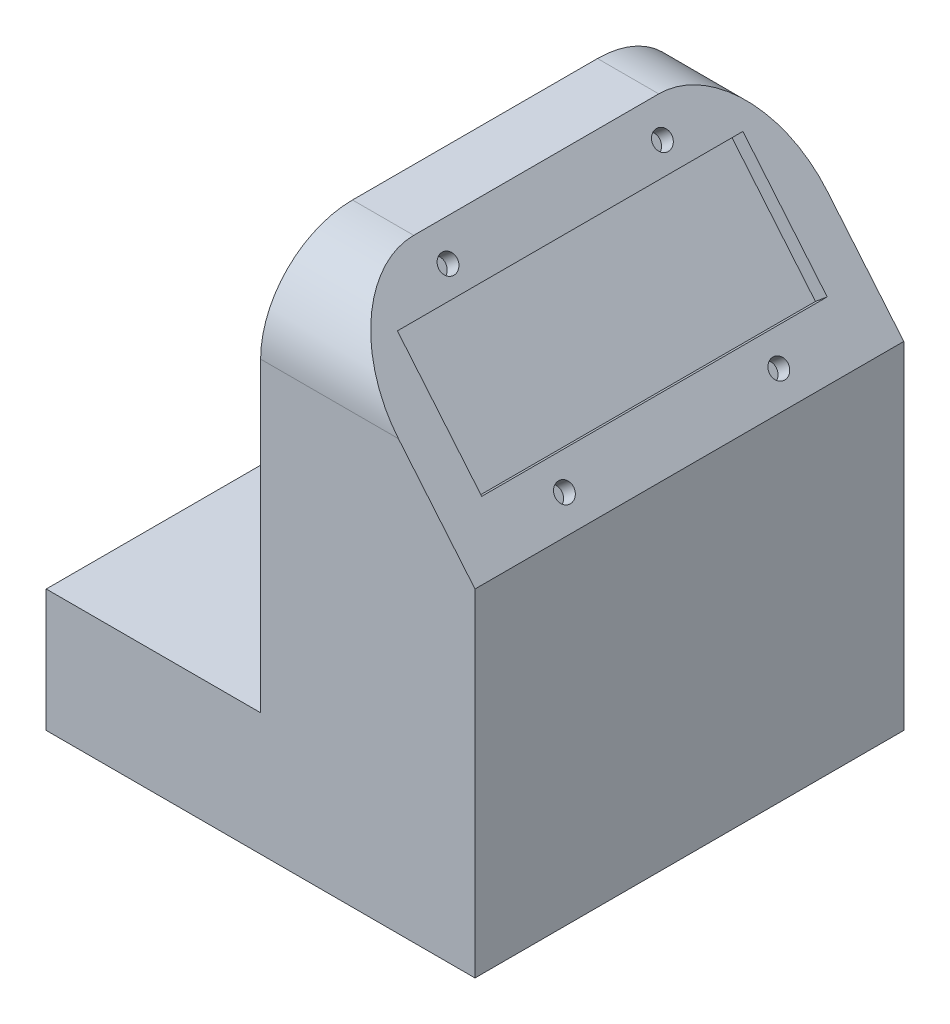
ISO-10303-21;
HEADER;
FILE_DESCRIPTION(('STEP AP214'),'2;1');
FILE_NAME('part.step','',(''),(''),'','','');
FILE_SCHEMA(('AUTOMOTIVE_DESIGN { 1 0 10303 214 1 1 1 1 }'));
ENDSEC;
DATA;
#1=APPLICATION_CONTEXT('core data for automotive mechanical design processes');
#2=APPLICATION_PROTOCOL_DEFINITION('international standard','automotive_design',2000,#1);
#3=PRODUCT_CONTEXT('',#1,'mechanical');
#4=PRODUCT('Part','Part','',(#3));
#5=PRODUCT_RELATED_PRODUCT_CATEGORY('part','',(#4));
#6=PRODUCT_DEFINITION_FORMATION('','',#4);
#7=PRODUCT_DEFINITION_CONTEXT('part definition',#1,'design');
#8=PRODUCT_DEFINITION('design','',#6,#7);
#9=PRODUCT_DEFINITION_SHAPE('','',#8);
#10=(LENGTH_UNIT() NAMED_UNIT(*) SI_UNIT(.MILLI.,.METRE.));
#11=(NAMED_UNIT(*) PLANE_ANGLE_UNIT() SI_UNIT($,.RADIAN.));
#12=(NAMED_UNIT(*) SI_UNIT($,.STERADIAN.) SOLID_ANGLE_UNIT());
#13=UNCERTAINTY_MEASURE_WITH_UNIT(LENGTH_MEASURE(1.E-05),#10,'distance_accuracy_value','');
#14=(GEOMETRIC_REPRESENTATION_CONTEXT(3) GLOBAL_UNCERTAINTY_ASSIGNED_CONTEXT((#13)) GLOBAL_UNIT_ASSIGNED_CONTEXT((#10,
#11,#12)) REPRESENTATION_CONTEXT('',''));
#15=CARTESIAN_POINT('',(0.,0.,0.));
#16=DIRECTION('',(0.,0.,1.));
#17=DIRECTION('',(1.,0.,0.));
#18=AXIS2_PLACEMENT_3D('',#15,#16,#17);
#19=CARTESIAN_POINT('',(57.15,107.95,-182.656626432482));
#20=DIRECTION('',(0.,1.,0.));
#21=DIRECTION('',(-1.,0.,0.));
#22=AXIS2_PLACEMENT_3D('',#19,#20,#21);
#23=PLANE('',#22);
#24=DIRECTION('',(1.,0.,0.));
#25=VECTOR('',#24,1.);
#26=CARTESIAN_POINT('',(-175.827081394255,107.95,-19.0500000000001));
#27=LINE('',#26,#25);
#28=CARTESIAN_POINT('',(44.45,107.95,-19.0500000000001));
#29=VERTEX_POINT('',#28);
#30=CARTESIAN_POINT('',(57.15,107.95,-19.0500000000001));
#31=VERTEX_POINT('',#30);
#32=EDGE_CURVE('E290',#29,#31,#27,.T.);
#33=ORIENTED_EDGE('',*,*,#32,.T.);
#34=DIRECTION('',(0.,0.,1.));
#35=VECTOR('',#34,1.);
#36=CARTESIAN_POINT('',(57.15,107.95,-182.656626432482));
#37=LINE('',#36,#35);
#38=CARTESIAN_POINT('',(57.15,107.95,-69.85));
#39=VERTEX_POINT('',#38);
#40=EDGE_CURVE('E209',#39,#31,#37,.T.);
#41=ORIENTED_EDGE('',*,*,#40,.F.);
#42=DIRECTION('',(1.,0.,0.));
#43=VECTOR('',#42,1.);
#44=CARTESIAN_POINT('',(-175.827081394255,107.95,-69.8499999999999));
#45=LINE('',#44,#43);
#46=CARTESIAN_POINT('',(44.45,107.95,-69.8499999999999));
#47=VERTEX_POINT('',#46);
#48=EDGE_CURVE('E57',#47,#39,#45,.T.);
#49=ORIENTED_EDGE('',*,*,#48,.F.);
#50=DIRECTION('',(0.,0.,1.));
#51=VECTOR('',#50,1.);
#52=CARTESIAN_POINT('',(44.45,107.95,-182.656626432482));
#53=LINE('',#52,#51);
#54=EDGE_CURVE('E144',#47,#29,#53,.T.);
#55=ORIENTED_EDGE('',*,*,#54,.T.);
#56=EDGE_LOOP('',(#33,#41,#49,#55));
#57=FACE_BOUND('',#56,.T.);
#58=ADVANCED_FACE('F33',(#57),#23,.T.);
#59=CARTESIAN_POINT('',(0.,25.4,-88.9));
#60=DIRECTION('',(0.,-1.,0.));
#61=DIRECTION('',(0.,0.,-1.));
#62=AXIS2_PLACEMENT_3D('',#59,#60,#61);
#63=PLANE('',#62);
#64=DIRECTION('',(0.,0.,1.));
#65=VECTOR('',#64,1.);
#66=CARTESIAN_POINT('',(44.45,25.4,-182.656626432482));
#67=LINE('',#66,#65);
#68=CARTESIAN_POINT('',(44.45,25.4,-88.9));
#69=VERTEX_POINT('',#68);
#70=CARTESIAN_POINT('',(44.45,25.4,0.));
#71=VERTEX_POINT('',#70);
#72=EDGE_CURVE('E156',#69,#71,#67,.T.);
#73=ORIENTED_EDGE('',*,*,#72,.F.);
#74=DIRECTION('',(-1.,0.,0.));
#75=VECTOR('',#74,1.);
#76=CARTESIAN_POINT('',(0.,25.4,-88.9));
#77=LINE('',#76,#75);
#78=CARTESIAN_POINT('',(0.,25.4,-88.9));
#79=VERTEX_POINT('',#78);
#80=EDGE_CURVE('E149',#69,#79,#77,.T.);
#81=ORIENTED_EDGE('',*,*,#80,.T.);
#82=DIRECTION('',(0.,0.,1.));
#83=VECTOR('',#82,1.);
#84=CARTESIAN_POINT('',(0.,25.4,0.));
#85=LINE('',#84,#83);
#86=CARTESIAN_POINT('',(0.,25.4,0.));
#87=VERTEX_POINT('',#86);
#88=EDGE_CURVE('E178',#79,#87,#85,.T.);
#89=ORIENTED_EDGE('',*,*,#88,.T.);
#90=DIRECTION('',(1.,0.,0.));
#91=VECTOR('',#90,1.);
#92=CARTESIAN_POINT('',(0.,25.4,0.));
#93=LINE('',#92,#91);
#94=EDGE_CURVE('E174',#87,#71,#93,.T.);
#95=ORIENTED_EDGE('',*,*,#94,.T.);
#96=EDGE_LOOP('',(#73,#81,#89,#95));
#97=FACE_BOUND('',#96,.T.);
#98=ADVANCED_FACE('F207',(#97),#63,.F.);
#99=CARTESIAN_POINT('',(0.,25.4,0.));
#100=DIRECTION('',(1.,0.,0.));
#101=DIRECTION('',(0.,0.,-1.));
#102=AXIS2_PLACEMENT_3D('',#99,#100,#101);
#103=PLANE('',#102);
#104=DIRECTION('',(0.,0.,1.));
#105=VECTOR('',#104,1.);
#106=CARTESIAN_POINT('',(0.,0.,0.));
#107=LINE('',#106,#105);
#108=CARTESIAN_POINT('',(0.,0.,-88.9));
#109=VERTEX_POINT('',#108);
#110=CARTESIAN_POINT('',(0.,0.,0.));
#111=VERTEX_POINT('',#110);
#112=EDGE_CURVE('E150',#109,#111,#107,.T.);
#113=ORIENTED_EDGE('',*,*,#112,.T.);
#114=DIRECTION('',(0.,-1.,0.));
#115=VECTOR('',#114,1.);
#116=CARTESIAN_POINT('',(0.,25.4,0.));
#117=LINE('',#116,#115);
#118=EDGE_CURVE('E163',#87,#111,#117,.T.);
#119=ORIENTED_EDGE('',*,*,#118,.F.);
#120=ORIENTED_EDGE('',*,*,#88,.F.);
#121=DIRECTION('',(0.,-1.,0.));
#122=VECTOR('',#121,1.);
#123=CARTESIAN_POINT('',(0.,25.4,-88.9));
#124=LINE('',#123,#122);
#125=EDGE_CURVE('E191',#79,#109,#124,.T.);
#126=ORIENTED_EDGE('',*,*,#125,.T.);
#127=EDGE_LOOP('',(#113,#119,#120,#126));
#128=FACE_BOUND('',#127,.T.);
#129=ADVANCED_FACE('F35',(#128),#103,.F.);
#130=CARTESIAN_POINT('',(0.,25.4,0.));
#131=DIRECTION('',(0.,0.,-1.));
#132=DIRECTION('',(-1.,0.,0.));
#133=AXIS2_PLACEMENT_3D('',#130,#131,#132);
#134=PLANE('',#133);
#135=DIRECTION('',(1.,0.,0.));
#136=VECTOR('',#135,1.);
#137=CARTESIAN_POINT('',(0.,0.,0.));
#138=LINE('',#137,#136);
#139=CARTESIAN_POINT('',(88.9,0.,0.));
#140=VERTEX_POINT('',#139);
#141=EDGE_CURVE('E154',#111,#140,#138,.T.);
#142=ORIENTED_EDGE('',*,*,#141,.T.);
#143=DIRECTION('',(0.,-1.,0.));
#144=VECTOR('',#143,1.);
#145=CARTESIAN_POINT('',(88.9,25.4,0.));
#146=LINE('',#145,#144);
#147=CARTESIAN_POINT('',(88.9,69.85,0.));
#148=VERTEX_POINT('',#147);
#149=EDGE_CURVE('E165',#148,#140,#146,.T.);
#150=ORIENTED_EDGE('',*,*,#149,.F.);
#151=DIRECTION('',(-0.64018439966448,0.768221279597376,0.));
#152=VECTOR('',#151,1.);
#153=CARTESIAN_POINT('',(88.9,69.85,0.));
#154=LINE('',#153,#152);
#155=CARTESIAN_POINT('',(73.025,88.9,0.));
#156=VERTEX_POINT('',#155);
#157=EDGE_CURVE('E214',#148,#156,#154,.T.);
#158=ORIENTED_EDGE('',*,*,#157,.T.);
#159=DIRECTION('',(1.,0.,0.));
#160=VECTOR('',#159,1.);
#161=CARTESIAN_POINT('',(-175.827081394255,88.8999999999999,0.));
#162=LINE('',#161,#160);
#163=CARTESIAN_POINT('',(44.45,88.8999999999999,0.));
#164=VERTEX_POINT('',#163);
#165=EDGE_CURVE('E49',#164,#156,#162,.T.);
#166=ORIENTED_EDGE('',*,*,#165,.F.);
#167=DIRECTION('',(0.,-1.,0.));
#168=VECTOR('',#167,1.);
#169=CARTESIAN_POINT('',(44.45,107.95,0.));
#170=LINE('',#169,#168);
#171=EDGE_CURVE('E37',#164,#71,#170,.T.);
#172=ORIENTED_EDGE('',*,*,#171,.T.);
#173=ORIENTED_EDGE('',*,*,#94,.F.);
#174=ORIENTED_EDGE('',*,*,#118,.T.);
#175=EDGE_LOOP('',(#142,#150,#158,#166,#172,#173,#174));
#176=FACE_BOUND('',#175,.T.);
#177=ADVANCED_FACE('F325',(#176),#134,.F.);
#178=CARTESIAN_POINT('',(88.9,25.4,0.));
#179=DIRECTION('',(-1.,0.,0.));
#180=DIRECTION('',(0.,0.,1.));
#181=AXIS2_PLACEMENT_3D('',#178,#179,#180);
#182=PLANE('',#181);
#183=DIRECTION('',(0.,0.,-1.));
#184=VECTOR('',#183,1.);
#185=CARTESIAN_POINT('',(88.9,0.,0.));
#186=LINE('',#185,#184);
#187=CARTESIAN_POINT('',(88.9,0.,-88.9));
#188=VERTEX_POINT('',#187);
#189=EDGE_CURVE('E186',#140,#188,#186,.T.);
#190=ORIENTED_EDGE('',*,*,#189,.T.);
#191=DIRECTION('',(0.,-1.,0.));
#192=VECTOR('',#191,1.);
#193=CARTESIAN_POINT('',(88.9,25.4,-88.9));
#194=LINE('',#193,#192);
#195=CARTESIAN_POINT('',(88.9,69.85,-88.9));
#196=VERTEX_POINT('',#195);
#197=EDGE_CURVE('E170',#196,#188,#194,.T.);
#198=ORIENTED_EDGE('',*,*,#197,.F.);
#199=DIRECTION('',(0.,0.,1.));
#200=VECTOR('',#199,1.);
#201=CARTESIAN_POINT('',(88.9,69.85,-182.656626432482));
#202=LINE('',#201,#200);
#203=EDGE_CURVE('E217',#196,#148,#202,.T.);
#204=ORIENTED_EDGE('',*,*,#203,.T.);
#205=ORIENTED_EDGE('',*,*,#149,.T.);
#206=EDGE_LOOP('',(#190,#198,#204,#205));
#207=FACE_BOUND('',#206,.T.);
#208=ADVANCED_FACE('F199',(#207),#182,.F.);
#209=CARTESIAN_POINT('',(0.,25.4,-88.9));
#210=DIRECTION('',(0.,0.,1.));
#211=DIRECTION('',(1.,0.,0.));
#212=AXIS2_PLACEMENT_3D('',#209,#210,#211);
#213=PLANE('',#212);
#214=ORIENTED_EDGE('',*,*,#80,.F.);
#215=DIRECTION('',(0.,1.,0.));
#216=VECTOR('',#215,1.);
#217=CARTESIAN_POINT('',(44.45,107.95,-88.9));
#218=LINE('',#217,#216);
#219=CARTESIAN_POINT('',(44.45,88.8999999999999,-88.9));
#220=VERTEX_POINT('',#219);
#221=EDGE_CURVE('E142',#69,#220,#218,.T.);
#222=ORIENTED_EDGE('',*,*,#221,.T.);
#223=DIRECTION('',(1.,0.,0.));
#224=VECTOR('',#223,1.);
#225=CARTESIAN_POINT('',(-175.827081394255,88.8999999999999,-88.9));
#226=LINE('',#225,#224);
#227=CARTESIAN_POINT('',(73.0250000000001,88.8999999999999,-88.9));
#228=VERTEX_POINT('',#227);
#229=EDGE_CURVE('E127',#220,#228,#226,.T.);
#230=ORIENTED_EDGE('',*,*,#229,.T.);
#231=DIRECTION('',(0.64018439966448,-0.768221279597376,0.));
#232=VECTOR('',#231,1.);
#233=CARTESIAN_POINT('',(88.9,69.85,-88.9));
#234=LINE('',#233,#232);
#235=EDGE_CURVE('E151',#228,#196,#234,.T.);
#236=ORIENTED_EDGE('',*,*,#235,.T.);
#237=ORIENTED_EDGE('',*,*,#197,.T.);
#238=DIRECTION('',(-1.,0.,0.));
#239=VECTOR('',#238,1.);
#240=CARTESIAN_POINT('',(0.,0.,-88.9));
#241=LINE('',#240,#239);
#242=EDGE_CURVE('E189',#188,#109,#241,.T.);
#243=ORIENTED_EDGE('',*,*,#242,.T.);
#244=ORIENTED_EDGE('',*,*,#125,.F.);
#245=EDGE_LOOP('',(#214,#222,#230,#236,#237,#243,#244));
#246=FACE_BOUND('',#245,.T.);
#247=ADVANCED_FACE('F147',(#246),#213,.F.);
#248=CARTESIAN_POINT('',(0.,0.,-88.9));
#249=DIRECTION('',(0.,-1.,0.));
#250=DIRECTION('',(0.,0.,-1.));
#251=AXIS2_PLACEMENT_3D('',#248,#249,#250);
#252=PLANE('',#251);
#253=ORIENTED_EDGE('',*,*,#112,.F.);
#254=ORIENTED_EDGE('',*,*,#242,.F.);
#255=ORIENTED_EDGE('',*,*,#189,.F.);
#256=ORIENTED_EDGE('',*,*,#141,.F.);
#257=EDGE_LOOP('',(#253,#254,#255,#256));
#258=FACE_BOUND('',#257,.T.);
#259=ADVANCED_FACE('F202',(#258),#252,.T.);
#260=CARTESIAN_POINT('',(44.45,107.95,-182.656626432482));
#261=DIRECTION('',(-1.,0.,0.));
#262=DIRECTION('',(0.,-1.,0.));
#263=AXIS2_PLACEMENT_3D('',#260,#261,#262);
#264=PLANE('',#263);
#265=CARTESIAN_POINT('',(44.45,88.9,-19.05));
#266=DIRECTION('',(-1.,0.,0.));
#267=DIRECTION('',(0.,-1.,0.));
#268=AXIS2_PLACEMENT_3D('',#265,#266,#267);
#269=CIRCLE('',#268,19.05);
#270=EDGE_CURVE('E289',#164,#29,#269,.T.);
#271=ORIENTED_EDGE('',*,*,#270,.T.);
#272=ORIENTED_EDGE('',*,*,#54,.F.);
#273=CARTESIAN_POINT('',(44.45,88.9,-69.85));
#274=DIRECTION('',(-1.,0.,0.));
#275=DIRECTION('',(0.,-1.,0.));
#276=AXIS2_PLACEMENT_3D('',#273,#274,#275);
#277=CIRCLE('',#276,19.05);
#278=EDGE_CURVE('E130',#47,#220,#277,.T.);
#279=ORIENTED_EDGE('',*,*,#278,.T.);
#280=ORIENTED_EDGE('',*,*,#221,.F.);
#281=ORIENTED_EDGE('',*,*,#72,.T.);
#282=ORIENTED_EDGE('',*,*,#171,.F.);
#283=EDGE_LOOP('',(#271,#272,#279,#280,#281,#282));
#284=FACE_BOUND('',#283,.T.);
#285=ADVANCED_FACE('F140',(#284),#264,.T.);
#286=CARTESIAN_POINT('',(88.9,69.85,-182.656626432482));
#287=DIRECTION('',(0.768221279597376,0.64018439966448,0.));
#288=DIRECTION('',(-0.64018439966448,0.768221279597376,0.));
#289=AXIS2_PLACEMENT_3D('',#286,#287,#288);
#290=PLANE('',#289);
#291=CARTESIAN_POINT('',(73.025,88.9,-19.05));
#292=DIRECTION('',(0.768221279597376,0.64018439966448,0.));
#293=DIRECTION('',(0.64018439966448,-0.768221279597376,0.));
#294=AXIS2_PLACEMENT_3D('',#291,#292,#293);
#295=ELLIPSE('',#294,24.7975427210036,19.05);
#296=EDGE_CURVE('E11',#156,#31,#295,.F.);
#297=ORIENTED_EDGE('',*,*,#296,.F.);
#298=ORIENTED_EDGE('',*,*,#157,.F.);
#299=ORIENTED_EDGE('',*,*,#203,.F.);
#300=ORIENTED_EDGE('',*,*,#235,.F.);
#301=CARTESIAN_POINT('',(73.025,88.9,-69.85));
#302=DIRECTION('',(0.768221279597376,0.64018439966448,0.));
#303=DIRECTION('',(0.64018439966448,-0.768221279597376,0.));
#304=AXIS2_PLACEMENT_3D('',#301,#302,#303);
#305=ELLIPSE('',#304,24.7975427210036,19.05);
#306=EDGE_CURVE('E43',#39,#228,#305,.F.);
#307=ORIENTED_EDGE('',*,*,#306,.F.);
#308=ORIENTED_EDGE('',*,*,#40,.T.);
#309=EDGE_LOOP('',(#297,#298,#299,#300,#307,#308));
#310=FACE_BOUND('',#309,.T.);
#311=CARTESIAN_POINT('',(85.220406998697,74.2655116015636,-66.675));
#312=DIRECTION('',(0.768221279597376,0.64018439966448,0.));
#313=DIRECTION('',(-0.64018439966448,0.768221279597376,0.));
#314=AXIS2_PLACEMENT_3D('',#311,#312,#313);
#315=CIRCLE('',#314,1.90500000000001);
#316=CARTESIAN_POINT('',(84.0008557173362,75.7289731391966,-66.675));
#317=VERTEX_POINT('',#316);
#318=EDGE_CURVE('E134',#317,#317,#315,.T.);
#319=ORIENTED_EDGE('',*,*,#318,.F.);
#320=EDGE_LOOP('',(#319));
#321=FACE_BOUND('',#320,.T.);
#322=CARTESIAN_POINT('',(61.0817749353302,103.231870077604,-66.675));
#323=DIRECTION('',(0.768221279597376,0.64018439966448,0.));
#324=DIRECTION('',(-0.64018439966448,0.768221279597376,0.));
#325=AXIS2_PLACEMENT_3D('',#322,#323,#324);
#326=CIRCLE('',#325,1.905);
#327=CARTESIAN_POINT('',(59.8622236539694,104.695331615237,-66.675));
#328=VERTEX_POINT('',#327);
#329=EDGE_CURVE('E278',#328,#328,#326,.T.);
#330=ORIENTED_EDGE('',*,*,#329,.F.);
#331=EDGE_LOOP('',(#330));
#332=FACE_BOUND('',#331,.T.);
#333=CARTESIAN_POINT('',(85.220406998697,74.2655116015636,-22.225));
#334=DIRECTION('',(0.768221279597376,0.64018439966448,0.));
#335=DIRECTION('',(-0.64018439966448,0.768221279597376,0.));
#336=AXIS2_PLACEMENT_3D('',#333,#334,#335);
#337=CIRCLE('',#336,1.905);
#338=CARTESIAN_POINT('',(84.0008557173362,75.7289731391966,-22.225));
#339=VERTEX_POINT('',#338);
#340=EDGE_CURVE('E272',#339,#339,#337,.T.);
#341=ORIENTED_EDGE('',*,*,#340,.F.);
#342=EDGE_LOOP('',(#341));
#343=FACE_BOUND('',#342,.T.);
#344=CARTESIAN_POINT('',(61.0817749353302,103.231870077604,-22.225));
#345=DIRECTION('',(0.768221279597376,0.64018439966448,0.));
#346=DIRECTION('',(-0.64018439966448,0.768221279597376,0.));
#347=AXIS2_PLACEMENT_3D('',#344,#345,#346);
#348=CIRCLE('',#347,1.905);
#349=CARTESIAN_POINT('',(59.8622236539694,104.695331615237,-22.225));
#350=VERTEX_POINT('',#349);
#351=EDGE_CURVE('E266',#350,#350,#348,.T.);
#352=ORIENTED_EDGE('',*,*,#351,.F.);
#353=EDGE_LOOP('',(#352));
#354=FACE_BOUND('',#353,.T.);
#355=DIRECTION('',(0.64018439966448,-0.768221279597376,0.));
#356=VECTOR('',#355,1.);
#357=CARTESIAN_POINT('',(64.1769210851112,99.5176946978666,-8.63600000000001));
#358=LINE('',#357,#356);
#359=CARTESIAN_POINT('',(64.1769210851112,99.5176946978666,-8.63600000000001));
#360=VERTEX_POINT('',#359);
#361=CARTESIAN_POINT('',(81.6571561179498,78.5414126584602,-8.636));
#362=VERTEX_POINT('',#361);
#363=EDGE_CURVE('E251',#360,#362,#358,.T.);
#364=ORIENTED_EDGE('',*,*,#363,.F.);
#365=DIRECTION('',(0.,0.,1.));
#366=VECTOR('',#365,1.);
#367=CARTESIAN_POINT('',(64.1769210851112,99.5176946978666,-8.63600000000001));
#368=LINE('',#367,#366);
#369=CARTESIAN_POINT('',(64.1769210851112,99.5176946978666,-80.264));
#370=VERTEX_POINT('',#369);
#371=EDGE_CURVE('E229',#370,#360,#368,.T.);
#372=ORIENTED_EDGE('',*,*,#371,.F.);
#373=DIRECTION('',(-0.64018439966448,0.768221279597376,0.));
#374=VECTOR('',#373,1.);
#375=CARTESIAN_POINT('',(64.1769210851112,99.5176946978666,-80.264));
#376=LINE('',#375,#374);
#377=CARTESIAN_POINT('',(81.6571561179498,78.5414126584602,-80.264));
#378=VERTEX_POINT('',#377);
#379=EDGE_CURVE('E255',#378,#370,#376,.T.);
#380=ORIENTED_EDGE('',*,*,#379,.F.);
#381=DIRECTION('',(0.,0.,-1.));
#382=VECTOR('',#381,1.);
#383=CARTESIAN_POINT('',(81.6571561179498,78.5414126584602,-8.63600000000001));
#384=LINE('',#383,#382);
#385=EDGE_CURVE('E253',#362,#378,#384,.T.);
#386=ORIENTED_EDGE('',*,*,#385,.F.);
#387=EDGE_LOOP('',(#364,#372,#380,#386));
#388=FACE_BOUND('',#387,.T.);
#389=ADVANCED_FACE('F297',(#310,#321,#332,#343,#354,#388),#290,.T.);
#390=CARTESIAN_POINT('',(61.7378185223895,97.4851092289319,-8.63600000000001));
#391=DIRECTION('',(0.,0.,1.));
#392=DIRECTION('',(0.,-1.,0.));
#393=AXIS2_PLACEMENT_3D('',#390,#391,#392);
#394=PLANE('',#393);
#395=ORIENTED_EDGE('',*,*,#363,.T.);
#396=DIRECTION('',(0.768221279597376,0.64018439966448,0.));
#397=VECTOR('',#396,1.);
#398=CARTESIAN_POINT('',(79.2180535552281,76.5088271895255,-8.63600000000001));
#399=LINE('',#398,#397);
#400=CARTESIAN_POINT('',(79.2180535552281,76.5088271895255,-8.63600000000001));
#401=VERTEX_POINT('',#400);
#402=EDGE_CURVE('E233',#401,#362,#399,.T.);
#403=ORIENTED_EDGE('',*,*,#402,.F.);
#404=DIRECTION('',(0.64018439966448,-0.768221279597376,0.));
#405=VECTOR('',#404,1.);
#406=CARTESIAN_POINT('',(61.7378185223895,97.4851092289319,-8.63600000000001));
#407=LINE('',#406,#405);
#408=CARTESIAN_POINT('',(61.7378185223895,97.4851092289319,-8.63600000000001));
#409=VERTEX_POINT('',#408);
#410=EDGE_CURVE('E260',#409,#401,#407,.T.);
#411=ORIENTED_EDGE('',*,*,#410,.F.);
#412=DIRECTION('',(0.768221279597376,0.64018439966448,0.));
#413=VECTOR('',#412,1.);
#414=CARTESIAN_POINT('',(61.7378185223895,97.4851092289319,-8.63600000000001));
#415=LINE('',#414,#413);
#416=EDGE_CURVE('E220',#409,#360,#415,.T.);
#417=ORIENTED_EDGE('',*,*,#416,.T.);
#418=EDGE_LOOP('',(#395,#403,#411,#417));
#419=FACE_BOUND('',#418,.T.);
#420=ADVANCED_FACE('F318',(#419),#394,.F.);
#421=CARTESIAN_POINT('',(61.7378185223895,97.4851092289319,-8.63600000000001));
#422=DIRECTION('',(-0.64018439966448,0.768221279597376,0.));
#423=DIRECTION('',(-0.768221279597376,-0.64018439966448,0.));
#424=AXIS2_PLACEMENT_3D('',#421,#422,#423);
#425=PLANE('',#424);
#426=ORIENTED_EDGE('',*,*,#371,.T.);
#427=ORIENTED_EDGE('',*,*,#416,.F.);
#428=DIRECTION('',(0.,0.,1.));
#429=VECTOR('',#428,1.);
#430=CARTESIAN_POINT('',(61.7378185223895,97.4851092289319,-8.63600000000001));
#431=LINE('',#430,#429);
#432=CARTESIAN_POINT('',(61.7378185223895,97.4851092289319,-80.264));
#433=VERTEX_POINT('',#432);
#434=EDGE_CURVE('E235',#433,#409,#431,.T.);
#435=ORIENTED_EDGE('',*,*,#434,.F.);
#436=DIRECTION('',(0.768221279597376,0.64018439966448,0.));
#437=VECTOR('',#436,1.);
#438=CARTESIAN_POINT('',(61.7378185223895,97.4851092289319,-80.264));
#439=LINE('',#438,#437);
#440=EDGE_CURVE('E221',#433,#370,#439,.T.);
#441=ORIENTED_EDGE('',*,*,#440,.T.);
#442=EDGE_LOOP('',(#426,#427,#435,#441));
#443=FACE_BOUND('',#442,.T.);
#444=ADVANCED_FACE('F349',(#443),#425,.F.);
#445=CARTESIAN_POINT('',(61.7378185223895,97.4851092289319,-80.264));
#446=DIRECTION('',(0.,0.,-1.));
#447=DIRECTION('',(0.,1.,0.));
#448=AXIS2_PLACEMENT_3D('',#445,#446,#447);
#449=PLANE('',#448);
#450=ORIENTED_EDGE('',*,*,#379,.T.);
#451=ORIENTED_EDGE('',*,*,#440,.F.);
#452=DIRECTION('',(-0.64018439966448,0.768221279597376,0.));
#453=VECTOR('',#452,1.);
#454=CARTESIAN_POINT('',(61.7378185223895,97.4851092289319,-80.264));
#455=LINE('',#454,#453);
#456=CARTESIAN_POINT('',(79.2180535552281,76.5088271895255,-80.264));
#457=VERTEX_POINT('',#456);
#458=EDGE_CURVE('E241',#457,#433,#455,.T.);
#459=ORIENTED_EDGE('',*,*,#458,.F.);
#460=DIRECTION('',(0.768221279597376,0.64018439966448,0.));
#461=VECTOR('',#460,1.);
#462=CARTESIAN_POINT('',(79.2180535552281,76.5088271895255,-80.264));
#463=LINE('',#462,#461);
#464=EDGE_CURVE('E226',#457,#378,#463,.T.);
#465=ORIENTED_EDGE('',*,*,#464,.T.);
#466=EDGE_LOOP('',(#450,#451,#459,#465));
#467=FACE_BOUND('',#466,.T.);
#468=ADVANCED_FACE('F358',(#467),#449,.F.);
#469=CARTESIAN_POINT('',(79.2180535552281,76.5088271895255,-8.63600000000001));
#470=DIRECTION('',(0.64018439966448,-0.768221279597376,0.));
#471=DIRECTION('',(0.768221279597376,0.64018439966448,0.));
#472=AXIS2_PLACEMENT_3D('',#469,#470,#471);
#473=PLANE('',#472);
#474=ORIENTED_EDGE('',*,*,#385,.T.);
#475=ORIENTED_EDGE('',*,*,#464,.F.);
#476=DIRECTION('',(0.,0.,-1.));
#477=VECTOR('',#476,1.);
#478=CARTESIAN_POINT('',(79.2180535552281,76.5088271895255,-8.63600000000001));
#479=LINE('',#478,#477);
#480=EDGE_CURVE('E247',#401,#457,#479,.T.);
#481=ORIENTED_EDGE('',*,*,#480,.F.);
#482=ORIENTED_EDGE('',*,*,#402,.T.);
#483=EDGE_LOOP('',(#474,#475,#481,#482));
#484=FACE_BOUND('',#483,.T.);
#485=ADVANCED_FACE('F367',(#484),#473,.F.);
#486=CARTESIAN_POINT('',(79.2180535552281,76.5088271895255,-8.63600000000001));
#487=DIRECTION('',(0.768221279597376,0.64018439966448,0.));
#488=DIRECTION('',(-0.64018439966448,0.768221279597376,0.));
#489=AXIS2_PLACEMENT_3D('',#486,#487,#488);
#490=PLANE('',#489);
#491=ORIENTED_EDGE('',*,*,#410,.T.);
#492=ORIENTED_EDGE('',*,*,#480,.T.);
#493=ORIENTED_EDGE('',*,*,#458,.T.);
#494=ORIENTED_EDGE('',*,*,#434,.T.);
#495=EDGE_LOOP('',(#491,#492,#493,#494));
#496=FACE_BOUND('',#495,.T.);
#497=ADVANCED_FACE('F376',(#496),#490,.T.);
#498=CARTESIAN_POINT('',(58.6426723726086,101.199284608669,-22.225));
#499=DIRECTION('',(0.768221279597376,0.64018439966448,0.));
#500=DIRECTION('',(-0.64018439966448,0.768221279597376,0.));
#501=AXIS2_PLACEMENT_3D('',#498,#499,#500);
#502=CYLINDRICAL_SURFACE('',#501,1.905);
#503=CARTESIAN_POINT('',(58.6426723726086,101.199284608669,-22.225));
#504=DIRECTION('',(0.768221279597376,0.64018439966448,0.));
#505=DIRECTION('',(-0.64018439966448,0.768221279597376,0.));
#506=AXIS2_PLACEMENT_3D('',#503,#504,#505);
#507=CIRCLE('',#506,1.905);
#508=CARTESIAN_POINT('',(57.4231210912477,102.662746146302,-22.225));
#509=VERTEX_POINT('',#508);
#510=EDGE_CURVE('E254',#509,#509,#507,.T.);
#511=CARTESIAN_POINT('',(57.4231210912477,102.662746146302,-22.225));
#512=CARTESIAN_POINT('',(57.4485284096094,102.683918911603,-22.225));
#513=CARTESIAN_POINT('',(57.4739357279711,102.705091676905,-22.225));
#514=CARTESIAN_POINT('',(57.5247503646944,102.747437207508,-22.225));
#515=CARTESIAN_POINT('',(57.5501576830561,102.768609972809,-22.225));
#516=CARTESIAN_POINT('',(57.6009723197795,102.810955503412,-22.225));
#517=CARTESIAN_POINT('',(57.6263796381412,102.832128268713,-22.225));
#518=CARTESIAN_POINT('',(57.6771942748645,102.874473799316,-22.225));
#519=CARTESIAN_POINT('',(57.7026015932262,102.895646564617,-22.225));
#520=CARTESIAN_POINT('',(57.7534162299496,102.93799209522,-22.225));
#521=CARTESIAN_POINT('',(57.7788235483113,102.959164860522,-22.225));
#522=CARTESIAN_POINT('',(57.8296381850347,103.001510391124,-22.225));
#523=CARTESIAN_POINT('',(57.8550455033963,103.022683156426,-22.225));
#524=CARTESIAN_POINT('',(57.9058601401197,103.065028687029,-22.225));
#525=CARTESIAN_POINT('',(57.9312674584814,103.08620145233,-22.225));
#526=CARTESIAN_POINT('',(57.9820820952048,103.128546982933,-22.225));
#527=CARTESIAN_POINT('',(58.0074894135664,103.149719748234,-22.225));
#528=CARTESIAN_POINT('',(58.0583040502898,103.192065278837,-22.225));
#529=CARTESIAN_POINT('',(58.0837113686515,103.213238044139,-22.225));
#530=CARTESIAN_POINT('',(58.1345260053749,103.255583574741,-22.225));
#531=CARTESIAN_POINT('',(58.1599333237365,103.276756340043,-22.225));
#532=CARTESIAN_POINT('',(58.2107479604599,103.319101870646,-22.225));
#533=CARTESIAN_POINT('',(58.2361552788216,103.340274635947,-22.225));
#534=CARTESIAN_POINT('',(58.286969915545,103.38262016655,-22.225));
#535=CARTESIAN_POINT('',(58.3123772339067,103.403792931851,-22.225));
#536=CARTESIAN_POINT('',(58.36319187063,103.446138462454,-22.225));
#537=CARTESIAN_POINT('',(58.3885991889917,103.467311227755,-22.225));
#538=CARTESIAN_POINT('',(58.4394138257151,103.509656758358,-22.225));
#539=CARTESIAN_POINT('',(58.4648211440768,103.53082952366,-22.225));
#540=CARTESIAN_POINT('',(58.5156357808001,103.573175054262,-22.225));
#541=CARTESIAN_POINT('',(58.5410430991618,103.594347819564,-22.225));
#542=CARTESIAN_POINT('',(58.5918577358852,103.636693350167,-22.225));
#543=CARTESIAN_POINT('',(58.6172650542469,103.657866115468,-22.225));
#544=CARTESIAN_POINT('',(58.6680796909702,103.700211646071,-22.225));
#545=CARTESIAN_POINT('',(58.6934870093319,103.721384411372,-22.225));
#546=CARTESIAN_POINT('',(58.7443016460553,103.763729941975,-22.225));
#547=CARTESIAN_POINT('',(58.769708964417,103.784902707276,-22.225));
#548=CARTESIAN_POINT('',(58.8205236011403,103.827248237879,-22.225));
#549=CARTESIAN_POINT('',(58.845930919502,103.848421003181,-22.225));
#550=CARTESIAN_POINT('',(58.8967455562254,103.890766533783,-22.225));
#551=CARTESIAN_POINT('',(58.9221528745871,103.911939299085,-22.225));
#552=CARTESIAN_POINT('',(58.9729675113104,103.954284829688,-22.225));
#553=CARTESIAN_POINT('',(58.9983748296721,103.975457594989,-22.225));
#554=CARTESIAN_POINT('',(59.0491894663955,104.017803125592,-22.225));
#555=CARTESIAN_POINT('',(59.0745967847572,104.038975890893,-22.225));
#556=CARTESIAN_POINT('',(59.1254114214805,104.081321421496,-22.225));
#557=CARTESIAN_POINT('',(59.1508187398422,104.102494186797,-22.225));
#558=CARTESIAN_POINT('',(59.2016333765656,104.1448397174,-22.225));
#559=CARTESIAN_POINT('',(59.2270406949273,104.166012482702,-22.225));
#560=CARTESIAN_POINT('',(59.2778553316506,104.208358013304,-22.225));
#561=CARTESIAN_POINT('',(59.3032626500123,104.229530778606,-22.225));
#562=CARTESIAN_POINT('',(59.3540772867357,104.271876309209,-22.225));
#563=CARTESIAN_POINT('',(59.3794846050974,104.29304907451,-22.225));
#564=CARTESIAN_POINT('',(59.4302992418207,104.335394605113,-22.225));
#565=CARTESIAN_POINT('',(59.4557065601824,104.356567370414,-22.225));
#566=CARTESIAN_POINT('',(59.5065211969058,104.398912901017,-22.225));
#567=CARTESIAN_POINT('',(59.5319285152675,104.420085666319,-22.225));
#568=CARTESIAN_POINT('',(59.5827431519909,104.462431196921,-22.225));
#569=CARTESIAN_POINT('',(59.6081504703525,104.483603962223,-22.225));
#570=CARTESIAN_POINT('',(59.6589651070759,104.525949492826,-22.225));
#571=CARTESIAN_POINT('',(59.6843724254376,104.547122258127,-22.225));
#572=CARTESIAN_POINT('',(59.735187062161,104.58946778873,-22.225));
#573=CARTESIAN_POINT('',(59.7605943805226,104.610640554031,-22.225));
#574=CARTESIAN_POINT('',(59.811409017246,104.652986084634,-22.225));
#575=CARTESIAN_POINT('',(59.8368163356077,104.674158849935,-22.225));
#576=CARTESIAN_POINT('',(59.8622236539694,104.695331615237,-22.225));
#577=B_SPLINE_CURVE_WITH_KNOTS('',3,(#511,#512,#513,#514,#515,#516,#517,#518,#519,#520,#521,
#522,#523,#524,#525,#526,#527,#528,#529,#530,#531,#532,#533,#534,#535,#536,#537,#538,#539,#540,
#541,#542,#543,#544,#545,#546,#547,#548,#549,#550,#551,#552,#553,#554,#555,#556,#557,#558,#559,
#560,#561,#562,#563,#564,#565,#566,#567,#568,#569,#570,#571,#572,#573,#574,#575,#576),
.UNSPECIFIED.,.F.,.F.,(4,2,2,2,2,2,2,2,2,2,2,2,2,2,2,2,2,2,2,2,2,2,2,2,2,2,2,2,2,2,2,2,4),(0.,
0.0992187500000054,0.198437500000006,0.297656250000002,0.396875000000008,0.496093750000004,
0.595312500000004,0.694531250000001,0.793750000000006,0.892968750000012,0.992187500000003,
1.09140625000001,1.190625,1.28984375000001,1.3890625,1.48828125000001,1.58750000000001,
1.68671875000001,1.78593750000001,1.88515625,1.98437500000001,2.08359375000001,2.18281250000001,
2.28203125,2.38125000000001,2.48046875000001,2.57968750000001,2.67890625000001,2.77812500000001,
2.87734375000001,2.9765625,3.07578125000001,3.17500000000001),.UNSPECIFIED.);
#578=EDGE_CURVE('BSEAM385',#509,#350,#577,.T.);
#579=ORIENTED_EDGE('',*,*,#510,.F.);
#580=ORIENTED_EDGE('',*,*,#351,.T.);
#581=ORIENTED_EDGE('',*,*,#578,.T.);
#582=ORIENTED_EDGE('',*,*,#578,.F.);
#583=EDGE_LOOP('',(#579,#581,#580,#582));
#584=FACE_BOUND('',#583,.T.);
#585=ADVANCED_FACE('F385',(#584),#502,.F.);
#586=CARTESIAN_POINT('',(58.6426723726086,101.199284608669,-22.225));
#587=DIRECTION('',(0.768221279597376,0.64018439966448,0.));
#588=DIRECTION('',(-0.64018439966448,0.768221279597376,0.));
#589=AXIS2_PLACEMENT_3D('',#586,#587,#588);
#590=PLANE('',#589);
#591=ORIENTED_EDGE('',*,*,#510,.T.);
#592=EDGE_LOOP('',(#591));
#593=FACE_BOUND('',#592,.T.);
#594=ADVANCED_FACE('F394',(#593),#590,.T.);
#595=CARTESIAN_POINT('',(82.7813044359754,72.2329261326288,-22.225));
#596=DIRECTION('',(0.768221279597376,0.64018439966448,0.));
#597=DIRECTION('',(-0.64018439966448,0.768221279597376,0.));
#598=AXIS2_PLACEMENT_3D('',#595,#596,#597);
#599=CYLINDRICAL_SURFACE('',#598,1.905);
#600=CARTESIAN_POINT('',(82.7813044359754,72.2329261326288,-22.225));
#601=DIRECTION('',(0.768221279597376,0.64018439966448,0.));
#602=DIRECTION('',(-0.64018439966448,0.768221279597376,0.));
#603=AXIS2_PLACEMENT_3D('',#600,#601,#602);
#604=CIRCLE('',#603,1.905);
#605=CARTESIAN_POINT('',(81.5617531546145,73.6963876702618,-22.225));
#606=VERTEX_POINT('',#605);
#607=EDGE_CURVE('E269',#606,#606,#604,.T.);
#608=CARTESIAN_POINT('',(81.5617531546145,73.6963876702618,-22.225));
#609=CARTESIAN_POINT('',(81.5871604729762,73.7175604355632,-22.225));
#610=CARTESIAN_POINT('',(81.6125677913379,73.7387332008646,-22.225));
#611=CARTESIAN_POINT('',(81.6633824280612,73.7810787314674,-22.225));
#612=CARTESIAN_POINT('',(81.6887897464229,73.8022514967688,-22.225));
#613=CARTESIAN_POINT('',(81.7396043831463,73.8445970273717,-22.225));
#614=CARTESIAN_POINT('',(81.765011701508,73.865769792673,-22.225));
#615=CARTESIAN_POINT('',(81.8158263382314,73.9081153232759,-22.225));
#616=CARTESIAN_POINT('',(81.841233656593,73.9292880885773,-22.225));
#617=CARTESIAN_POINT('',(81.8920482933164,73.9716336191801,-22.225));
#618=CARTESIAN_POINT('',(81.9174556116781,73.9928063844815,-22.225));
#619=CARTESIAN_POINT('',(81.9682702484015,74.0351519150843,-22.225));
#620=CARTESIAN_POINT('',(81.9936775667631,74.0563246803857,-22.225));
#621=CARTESIAN_POINT('',(82.0444922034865,74.0986702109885,-22.225));
#622=CARTESIAN_POINT('',(82.0698995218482,74.1198429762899,-22.225));
#623=CARTESIAN_POINT('',(82.1207141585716,74.1621885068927,-22.225));
#624=CARTESIAN_POINT('',(82.1461214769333,74.1833612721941,-22.225));
#625=CARTESIAN_POINT('',(82.1969361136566,74.2257068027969,-22.225));
#626=CARTESIAN_POINT('',(82.2223434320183,74.2468795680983,-22.225));
#627=CARTESIAN_POINT('',(82.2731580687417,74.2892250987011,-22.225));
#628=CARTESIAN_POINT('',(82.2985653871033,74.3103978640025,-22.225));
#629=CARTESIAN_POINT('',(82.3493800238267,74.3527433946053,-22.225));
#630=CARTESIAN_POINT('',(82.3747873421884,74.3739161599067,-22.225));
#631=CARTESIAN_POINT('',(82.4256019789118,74.4162616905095,-22.225));
#632=CARTESIAN_POINT('',(82.4510092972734,74.4374344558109,-22.225));
#633=CARTESIAN_POINT('',(82.5018239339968,74.4797799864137,-22.225));
#634=CARTESIAN_POINT('',(82.5272312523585,74.5009527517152,-22.225));
#635=CARTESIAN_POINT('',(82.5780458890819,74.543298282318,-22.225));
#636=CARTESIAN_POINT('',(82.6034532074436,74.5644710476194,-22.225));
#637=CARTESIAN_POINT('',(82.6542678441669,74.6068165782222,-22.225));
#638=CARTESIAN_POINT('',(82.6796751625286,74.6279893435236,-22.225));
#639=CARTESIAN_POINT('',(82.730489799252,74.6703348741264,-22.225));
#640=CARTESIAN_POINT('',(82.7558971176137,74.6915076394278,-22.225));
#641=CARTESIAN_POINT('',(82.806711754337,74.7338531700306,-22.225));
#642=CARTESIAN_POINT('',(82.8321190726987,74.755025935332,-22.225));
#643=CARTESIAN_POINT('',(82.8829337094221,74.7973714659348,-22.225));
#644=CARTESIAN_POINT('',(82.9083410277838,74.8185442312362,-22.225));
#645=CARTESIAN_POINT('',(82.9591556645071,74.860889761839,-22.225));
#646=CARTESIAN_POINT('',(82.9845629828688,74.8820625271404,-22.225));
#647=CARTESIAN_POINT('',(83.0353776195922,74.9244080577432,-22.225));
#648=CARTESIAN_POINT('',(83.0607849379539,74.9455808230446,-22.225));
#649=CARTESIAN_POINT('',(83.1115995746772,74.9879263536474,-22.225));
#650=CARTESIAN_POINT('',(83.1370068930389,75.0090991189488,-22.225));
#651=CARTESIAN_POINT('',(83.1878215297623,75.0514446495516,-22.225));
#652=CARTESIAN_POINT('',(83.213228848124,75.0726174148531,-22.225));
#653=CARTESIAN_POINT('',(83.2640434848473,75.1149629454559,-22.225));
#654=CARTESIAN_POINT('',(83.289450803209,75.1361357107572,-22.225));
#655=CARTESIAN_POINT('',(83.3402654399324,75.1784812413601,-22.225));
#656=CARTESIAN_POINT('',(83.3656727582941,75.1996540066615,-22.225));
#657=CARTESIAN_POINT('',(83.4164873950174,75.2419995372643,-22.225));
#658=CARTESIAN_POINT('',(83.4418947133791,75.2631723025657,-22.225));
#659=CARTESIAN_POINT('',(83.4927093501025,75.3055178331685,-22.225));
#660=CARTESIAN_POINT('',(83.5181166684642,75.3266905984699,-22.225));
#661=CARTESIAN_POINT('',(83.5689313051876,75.3690361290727,-22.225));
#662=CARTESIAN_POINT('',(83.5943386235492,75.3902088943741,-22.225));
#663=CARTESIAN_POINT('',(83.6451532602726,75.4325544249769,-22.225));
#664=CARTESIAN_POINT('',(83.6705605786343,75.4537271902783,-22.225));
#665=CARTESIAN_POINT('',(83.7213752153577,75.4960727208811,-22.225));
#666=CARTESIAN_POINT('',(83.7467825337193,75.5172454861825,-22.225));
#667=CARTESIAN_POINT('',(83.7975971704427,75.5595910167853,-22.225));
#668=CARTESIAN_POINT('',(83.8230044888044,75.5807637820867,-22.225));
#669=CARTESIAN_POINT('',(83.8738191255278,75.6231093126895,-22.225));
#670=CARTESIAN_POINT('',(83.8992264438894,75.6442820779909,-22.225));
#671=CARTESIAN_POINT('',(83.9500410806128,75.6866276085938,-22.225));
#672=CARTESIAN_POINT('',(83.9754483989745,75.7078003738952,-22.225));
#673=CARTESIAN_POINT('',(84.0008557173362,75.7289731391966,-22.225));
#674=B_SPLINE_CURVE_WITH_KNOTS('',3,(#608,#609,#610,#611,#612,#613,#614,#615,#616,#617,#618,
#619,#620,#621,#622,#623,#624,#625,#626,#627,#628,#629,#630,#631,#632,#633,#634,#635,#636,#637,
#638,#639,#640,#641,#642,#643,#644,#645,#646,#647,#648,#649,#650,#651,#652,#653,#654,#655,#656,
#657,#658,#659,#660,#661,#662,#663,#664,#665,#666,#667,#668,#669,#670,#671,#672,#673),
.UNSPECIFIED.,.F.,.F.,(4,2,2,2,2,2,2,2,2,2,2,2,2,2,2,2,2,2,2,2,2,2,2,2,2,2,2,2,2,2,2,2,4),(0.,
0.0992187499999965,0.198437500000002,0.297656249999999,0.396875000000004,0.49609375,
0.595312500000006,0.694531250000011,0.793750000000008,0.892968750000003,0.992187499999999,
1.09140625,1.190625,1.28984375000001,1.3890625,1.48828125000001,1.5875,1.68671875,1.7859375,
1.88515625,1.98437500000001,2.08359375,2.18281250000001,2.28203125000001,2.38125000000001,
2.48046875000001,2.5796875,2.67890625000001,2.778125,2.87734375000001,2.97656250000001,
3.07578125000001,3.175),.UNSPECIFIED.);
#675=EDGE_CURVE('BSEAM404',#606,#339,#674,.T.);
#676=ORIENTED_EDGE('',*,*,#607,.F.);
#677=ORIENTED_EDGE('',*,*,#340,.T.);
#678=ORIENTED_EDGE('',*,*,#675,.T.);
#679=ORIENTED_EDGE('',*,*,#675,.F.);
#680=EDGE_LOOP('',(#676,#678,#677,#679));
#681=FACE_BOUND('',#680,.T.);
#682=ADVANCED_FACE('F404',(#681),#599,.F.);
#683=CARTESIAN_POINT('',(82.7813044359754,72.2329261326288,-22.225));
#684=DIRECTION('',(0.768221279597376,0.64018439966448,0.));
#685=DIRECTION('',(-0.64018439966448,0.768221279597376,0.));
#686=AXIS2_PLACEMENT_3D('',#683,#684,#685);
#687=PLANE('',#686);
#688=ORIENTED_EDGE('',*,*,#607,.T.);
#689=EDGE_LOOP('',(#688));
#690=FACE_BOUND('',#689,.T.);
#691=ADVANCED_FACE('F414',(#690),#687,.T.);
#692=CARTESIAN_POINT('',(58.6426723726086,101.199284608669,-66.675));
#693=DIRECTION('',(0.768221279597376,0.64018439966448,0.));
#694=DIRECTION('',(-0.64018439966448,0.768221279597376,0.));
#695=AXIS2_PLACEMENT_3D('',#692,#693,#694);
#696=CYLINDRICAL_SURFACE('',#695,1.905);
#697=CARTESIAN_POINT('',(58.6426723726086,101.199284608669,-66.675));
#698=DIRECTION('',(0.768221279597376,0.64018439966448,0.));
#699=DIRECTION('',(-0.64018439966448,0.768221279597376,0.));
#700=AXIS2_PLACEMENT_3D('',#697,#698,#699);
#701=CIRCLE('',#700,1.905);
#702=CARTESIAN_POINT('',(57.4231210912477,102.662746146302,-66.675));
#703=VERTEX_POINT('',#702);
#704=EDGE_CURVE('E275',#703,#703,#701,.T.);
#705=CARTESIAN_POINT('',(57.4231210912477,102.662746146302,-66.675));
#706=CARTESIAN_POINT('',(57.4485284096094,102.683918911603,-66.675));
#707=CARTESIAN_POINT('',(57.4739357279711,102.705091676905,-66.675));
#708=CARTESIAN_POINT('',(57.5247503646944,102.747437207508,-66.675));
#709=CARTESIAN_POINT('',(57.5501576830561,102.768609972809,-66.675));
#710=CARTESIAN_POINT('',(57.6009723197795,102.810955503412,-66.675));
#711=CARTESIAN_POINT('',(57.6263796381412,102.832128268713,-66.675));
#712=CARTESIAN_POINT('',(57.6771942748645,102.874473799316,-66.675));
#713=CARTESIAN_POINT('',(57.7026015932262,102.895646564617,-66.675));
#714=CARTESIAN_POINT('',(57.7534162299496,102.93799209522,-66.675));
#715=CARTESIAN_POINT('',(57.7788235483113,102.959164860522,-66.675));
#716=CARTESIAN_POINT('',(57.8296381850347,103.001510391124,-66.675));
#717=CARTESIAN_POINT('',(57.8550455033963,103.022683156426,-66.675));
#718=CARTESIAN_POINT('',(57.9058601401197,103.065028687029,-66.675));
#719=CARTESIAN_POINT('',(57.9312674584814,103.08620145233,-66.675));
#720=CARTESIAN_POINT('',(57.9820820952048,103.128546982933,-66.675));
#721=CARTESIAN_POINT('',(58.0074894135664,103.149719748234,-66.675));
#722=CARTESIAN_POINT('',(58.0583040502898,103.192065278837,-66.675));
#723=CARTESIAN_POINT('',(58.0837113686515,103.213238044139,-66.675));
#724=CARTESIAN_POINT('',(58.1345260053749,103.255583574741,-66.675));
#725=CARTESIAN_POINT('',(58.1599333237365,103.276756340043,-66.675));
#726=CARTESIAN_POINT('',(58.2107479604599,103.319101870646,-66.675));
#727=CARTESIAN_POINT('',(58.2361552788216,103.340274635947,-66.675));
#728=CARTESIAN_POINT('',(58.286969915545,103.38262016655,-66.675));
#729=CARTESIAN_POINT('',(58.3123772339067,103.403792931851,-66.675));
#730=CARTESIAN_POINT('',(58.36319187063,103.446138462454,-66.675));
#731=CARTESIAN_POINT('',(58.3885991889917,103.467311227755,-66.675));
#732=CARTESIAN_POINT('',(58.4394138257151,103.509656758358,-66.675));
#733=CARTESIAN_POINT('',(58.4648211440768,103.53082952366,-66.675));
#734=CARTESIAN_POINT('',(58.5156357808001,103.573175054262,-66.675));
#735=CARTESIAN_POINT('',(58.5410430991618,103.594347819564,-66.675));
#736=CARTESIAN_POINT('',(58.5918577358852,103.636693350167,-66.675));
#737=CARTESIAN_POINT('',(58.6172650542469,103.657866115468,-66.675));
#738=CARTESIAN_POINT('',(58.6680796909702,103.700211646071,-66.675));
#739=CARTESIAN_POINT('',(58.6934870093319,103.721384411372,-66.675));
#740=CARTESIAN_POINT('',(58.7443016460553,103.763729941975,-66.675));
#741=CARTESIAN_POINT('',(58.769708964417,103.784902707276,-66.675));
#742=CARTESIAN_POINT('',(58.8205236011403,103.827248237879,-66.675));
#743=CARTESIAN_POINT('',(58.845930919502,103.848421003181,-66.675));
#744=CARTESIAN_POINT('',(58.8967455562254,103.890766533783,-66.675));
#745=CARTESIAN_POINT('',(58.9221528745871,103.911939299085,-66.675));
#746=CARTESIAN_POINT('',(58.9729675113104,103.954284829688,-66.675));
#747=CARTESIAN_POINT('',(58.9983748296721,103.975457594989,-66.675));
#748=CARTESIAN_POINT('',(59.0491894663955,104.017803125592,-66.675));
#749=CARTESIAN_POINT('',(59.0745967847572,104.038975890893,-66.675));
#750=CARTESIAN_POINT('',(59.1254114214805,104.081321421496,-66.675));
#751=CARTESIAN_POINT('',(59.1508187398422,104.102494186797,-66.675));
#752=CARTESIAN_POINT('',(59.2016333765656,104.1448397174,-66.675));
#753=CARTESIAN_POINT('',(59.2270406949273,104.166012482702,-66.675));
#754=CARTESIAN_POINT('',(59.2778553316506,104.208358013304,-66.675));
#755=CARTESIAN_POINT('',(59.3032626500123,104.229530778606,-66.675));
#756=CARTESIAN_POINT('',(59.3540772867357,104.271876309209,-66.675));
#757=CARTESIAN_POINT('',(59.3794846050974,104.29304907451,-66.675));
#758=CARTESIAN_POINT('',(59.4302992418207,104.335394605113,-66.675));
#759=CARTESIAN_POINT('',(59.4557065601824,104.356567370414,-66.675));
#760=CARTESIAN_POINT('',(59.5065211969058,104.398912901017,-66.675));
#761=CARTESIAN_POINT('',(59.5319285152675,104.420085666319,-66.675));
#762=CARTESIAN_POINT('',(59.5827431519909,104.462431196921,-66.675));
#763=CARTESIAN_POINT('',(59.6081504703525,104.483603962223,-66.675));
#764=CARTESIAN_POINT('',(59.6589651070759,104.525949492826,-66.675));
#765=CARTESIAN_POINT('',(59.6843724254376,104.547122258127,-66.675));
#766=CARTESIAN_POINT('',(59.735187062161,104.58946778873,-66.675));
#767=CARTESIAN_POINT('',(59.7605943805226,104.610640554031,-66.675));
#768=CARTESIAN_POINT('',(59.811409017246,104.652986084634,-66.675));
#769=CARTESIAN_POINT('',(59.8368163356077,104.674158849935,-66.675));
#770=CARTESIAN_POINT('',(59.8622236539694,104.695331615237,-66.675));
#771=B_SPLINE_CURVE_WITH_KNOTS('',3,(#705,#706,#707,#708,#709,#710,#711,#712,#713,#714,#715,
#716,#717,#718,#719,#720,#721,#722,#723,#724,#725,#726,#727,#728,#729,#730,#731,#732,#733,#734,
#735,#736,#737,#738,#739,#740,#741,#742,#743,#744,#745,#746,#747,#748,#749,#750,#751,#752,#753,
#754,#755,#756,#757,#758,#759,#760,#761,#762,#763,#764,#765,#766,#767,#768,#769,#770),
.UNSPECIFIED.,.F.,.F.,(4,2,2,2,2,2,2,2,2,2,2,2,2,2,2,2,2,2,2,2,2,2,2,2,2,2,2,2,2,2,2,2,4),(0.,
0.0992187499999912,0.198437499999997,0.297656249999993,0.396874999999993,0.496093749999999,
0.595312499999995,0.694531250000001,0.793749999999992,0.892968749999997,0.992187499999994,
1.09140625,1.19062499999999,1.28984375,1.3890625,1.48828125,1.5875,1.68671874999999,1.7859375,
1.88515624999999,1.984375,2.08359374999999,2.1828125,2.28203125,2.38124999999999,2.48046875,
2.5796875,2.67890625,2.77812499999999,2.87734375,2.97656249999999,3.07578124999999,
3.17499999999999),.UNSPECIFIED.);
#772=EDGE_CURVE('BSEAM424',#703,#328,#771,.T.);
#773=ORIENTED_EDGE('',*,*,#704,.F.);
#774=ORIENTED_EDGE('',*,*,#329,.T.);
#775=ORIENTED_EDGE('',*,*,#772,.T.);
#776=ORIENTED_EDGE('',*,*,#772,.F.);
#777=EDGE_LOOP('',(#773,#775,#774,#776));
#778=FACE_BOUND('',#777,.T.);
#779=ADVANCED_FACE('F424',(#778),#696,.F.);
#780=CARTESIAN_POINT('',(58.6426723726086,101.199284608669,-66.675));
#781=DIRECTION('',(0.768221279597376,0.64018439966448,0.));
#782=DIRECTION('',(-0.64018439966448,0.768221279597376,0.));
#783=AXIS2_PLACEMENT_3D('',#780,#781,#782);
#784=PLANE('',#783);
#785=ORIENTED_EDGE('',*,*,#704,.T.);
#786=EDGE_LOOP('',(#785));
#787=FACE_BOUND('',#786,.T.);
#788=ADVANCED_FACE('F434',(#787),#784,.T.);
#789=CARTESIAN_POINT('',(82.7813044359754,72.2329261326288,-66.675));
#790=DIRECTION('',(0.768221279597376,0.64018439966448,0.));
#791=DIRECTION('',(-0.64018439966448,0.768221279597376,0.));
#792=AXIS2_PLACEMENT_3D('',#789,#790,#791);
#793=CYLINDRICAL_SURFACE('',#792,1.90500000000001);
#794=CARTESIAN_POINT('',(82.7813044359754,72.2329261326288,-66.675));
#795=DIRECTION('',(0.768221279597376,0.64018439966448,0.));
#796=DIRECTION('',(-0.64018439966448,0.768221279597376,0.));
#797=AXIS2_PLACEMENT_3D('',#794,#795,#796);
#798=CIRCLE('',#797,1.90500000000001);
#799=CARTESIAN_POINT('',(81.5617531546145,73.6963876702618,-66.675));
#800=VERTEX_POINT('',#799);
#801=EDGE_CURVE('E281',#800,#800,#798,.T.);
#802=CARTESIAN_POINT('',(81.5617531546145,73.6963876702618,-66.675));
#803=CARTESIAN_POINT('',(81.5871604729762,73.7175604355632,-66.675));
#804=CARTESIAN_POINT('',(81.6125677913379,73.7387332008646,-66.675));
#805=CARTESIAN_POINT('',(81.6633824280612,73.7810787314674,-66.675));
#806=CARTESIAN_POINT('',(81.6887897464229,73.8022514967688,-66.675));
#807=CARTESIAN_POINT('',(81.7396043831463,73.8445970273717,-66.675));
#808=CARTESIAN_POINT('',(81.765011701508,73.865769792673,-66.675));
#809=CARTESIAN_POINT('',(81.8158263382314,73.9081153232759,-66.675));
#810=CARTESIAN_POINT('',(81.841233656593,73.9292880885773,-66.675));
#811=CARTESIAN_POINT('',(81.8920482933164,73.9716336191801,-66.675));
#812=CARTESIAN_POINT('',(81.9174556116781,73.9928063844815,-66.675));
#813=CARTESIAN_POINT('',(81.9682702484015,74.0351519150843,-66.675));
#814=CARTESIAN_POINT('',(81.9936775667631,74.0563246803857,-66.675));
#815=CARTESIAN_POINT('',(82.0444922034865,74.0986702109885,-66.675));
#816=CARTESIAN_POINT('',(82.0698995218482,74.1198429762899,-66.675));
#817=CARTESIAN_POINT('',(82.1207141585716,74.1621885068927,-66.675));
#818=CARTESIAN_POINT('',(82.1461214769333,74.1833612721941,-66.675));
#819=CARTESIAN_POINT('',(82.1969361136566,74.2257068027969,-66.675));
#820=CARTESIAN_POINT('',(82.2223434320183,74.2468795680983,-66.675));
#821=CARTESIAN_POINT('',(82.2731580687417,74.2892250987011,-66.675));
#822=CARTESIAN_POINT('',(82.2985653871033,74.3103978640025,-66.675));
#823=CARTESIAN_POINT('',(82.3493800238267,74.3527433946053,-66.675));
#824=CARTESIAN_POINT('',(82.3747873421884,74.3739161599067,-66.675));
#825=CARTESIAN_POINT('',(82.4256019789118,74.4162616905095,-66.675));
#826=CARTESIAN_POINT('',(82.4510092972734,74.4374344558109,-66.675));
#827=CARTESIAN_POINT('',(82.5018239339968,74.4797799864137,-66.675));
#828=CARTESIAN_POINT('',(82.5272312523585,74.5009527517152,-66.675));
#829=CARTESIAN_POINT('',(82.5780458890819,74.543298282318,-66.675));
#830=CARTESIAN_POINT('',(82.6034532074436,74.5644710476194,-66.675));
#831=CARTESIAN_POINT('',(82.6542678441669,74.6068165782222,-66.675));
#832=CARTESIAN_POINT('',(82.6796751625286,74.6279893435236,-66.675));
#833=CARTESIAN_POINT('',(82.730489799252,74.6703348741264,-66.675));
#834=CARTESIAN_POINT('',(82.7558971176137,74.6915076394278,-66.675));
#835=CARTESIAN_POINT('',(82.806711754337,74.7338531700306,-66.675));
#836=CARTESIAN_POINT('',(82.8321190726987,74.755025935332,-66.675));
#837=CARTESIAN_POINT('',(82.8829337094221,74.7973714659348,-66.675));
#838=CARTESIAN_POINT('',(82.9083410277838,74.8185442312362,-66.675));
#839=CARTESIAN_POINT('',(82.9591556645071,74.860889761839,-66.675));
#840=CARTESIAN_POINT('',(82.9845629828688,74.8820625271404,-66.675));
#841=CARTESIAN_POINT('',(83.0353776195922,74.9244080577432,-66.675));
#842=CARTESIAN_POINT('',(83.0607849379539,74.9455808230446,-66.675));
#843=CARTESIAN_POINT('',(83.1115995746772,74.9879263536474,-66.675));
#844=CARTESIAN_POINT('',(83.1370068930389,75.0090991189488,-66.675));
#845=CARTESIAN_POINT('',(83.1878215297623,75.0514446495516,-66.675));
#846=CARTESIAN_POINT('',(83.213228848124,75.0726174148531,-66.675));
#847=CARTESIAN_POINT('',(83.2640434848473,75.1149629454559,-66.675));
#848=CARTESIAN_POINT('',(83.289450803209,75.1361357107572,-66.675));
#849=CARTESIAN_POINT('',(83.3402654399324,75.1784812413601,-66.675));
#850=CARTESIAN_POINT('',(83.3656727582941,75.1996540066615,-66.675));
#851=CARTESIAN_POINT('',(83.4164873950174,75.2419995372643,-66.675));
#852=CARTESIAN_POINT('',(83.4418947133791,75.2631723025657,-66.675));
#853=CARTESIAN_POINT('',(83.4927093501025,75.3055178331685,-66.675));
#854=CARTESIAN_POINT('',(83.5181166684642,75.3266905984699,-66.675));
#855=CARTESIAN_POINT('',(83.5689313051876,75.3690361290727,-66.675));
#856=CARTESIAN_POINT('',(83.5943386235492,75.3902088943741,-66.675));
#857=CARTESIAN_POINT('',(83.6451532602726,75.4325544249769,-66.675));
#858=CARTESIAN_POINT('',(83.6705605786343,75.4537271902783,-66.675));
#859=CARTESIAN_POINT('',(83.7213752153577,75.4960727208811,-66.675));
#860=CARTESIAN_POINT('',(83.7467825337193,75.5172454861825,-66.675));
#861=CARTESIAN_POINT('',(83.7975971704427,75.5595910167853,-66.675));
#862=CARTESIAN_POINT('',(83.8230044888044,75.5807637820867,-66.675));
#863=CARTESIAN_POINT('',(83.8738191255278,75.6231093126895,-66.675));
#864=CARTESIAN_POINT('',(83.8992264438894,75.6442820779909,-66.675));
#865=CARTESIAN_POINT('',(83.9500410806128,75.6866276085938,-66.675));
#866=CARTESIAN_POINT('',(83.9754483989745,75.7078003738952,-66.675));
#867=CARTESIAN_POINT('',(84.0008557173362,75.7289731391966,-66.675));
#868=B_SPLINE_CURVE_WITH_KNOTS('',3,(#802,#803,#804,#805,#806,#807,#808,#809,#810,#811,#812,
#813,#814,#815,#816,#817,#818,#819,#820,#821,#822,#823,#824,#825,#826,#827,#828,#829,#830,#831,
#832,#833,#834,#835,#836,#837,#838,#839,#840,#841,#842,#843,#844,#845,#846,#847,#848,#849,#850,
#851,#852,#853,#854,#855,#856,#857,#858,#859,#860,#861,#862,#863,#864,#865,#866,#867),
.UNSPECIFIED.,.F.,.F.,(4,2,2,2,2,2,2,2,2,2,2,2,2,2,2,2,2,2,2,2,2,2,2,2,2,2,2,2,2,2,2,2,4),(0.,
0.0992187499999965,0.198437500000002,0.297656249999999,0.396875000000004,0.49609375,
0.595312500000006,0.694531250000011,0.793750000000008,0.892968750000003,0.992187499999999,
1.09140625,1.190625,1.28984375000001,1.3890625,1.48828125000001,1.5875,1.68671875,1.7859375,
1.88515625,1.98437500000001,2.08359375,2.18281250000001,2.28203125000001,2.38125000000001,
2.48046875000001,2.5796875,2.67890625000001,2.778125,2.87734375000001,2.97656250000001,
3.07578125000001,3.175),.UNSPECIFIED.);
#869=EDGE_CURVE('BSEAM444',#800,#317,#868,.T.);
#870=ORIENTED_EDGE('',*,*,#801,.F.);
#871=ORIENTED_EDGE('',*,*,#318,.T.);
#872=ORIENTED_EDGE('',*,*,#869,.T.);
#873=ORIENTED_EDGE('',*,*,#869,.F.);
#874=EDGE_LOOP('',(#870,#872,#871,#873));
#875=FACE_BOUND('',#874,.T.);
#876=ADVANCED_FACE('F444',(#875),#793,.F.);
#877=CARTESIAN_POINT('',(82.7813044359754,72.2329261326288,-66.675));
#878=DIRECTION('',(0.768221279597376,0.64018439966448,0.));
#879=DIRECTION('',(-0.64018439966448,0.768221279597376,0.));
#880=AXIS2_PLACEMENT_3D('',#877,#878,#879);
#881=PLANE('',#880);
#882=ORIENTED_EDGE('',*,*,#801,.T.);
#883=EDGE_LOOP('',(#882));
#884=FACE_BOUND('',#883,.T.);
#885=ADVANCED_FACE('F305',(#884),#881,.T.);
#886=CARTESIAN_POINT('',(-175.827081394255,88.9,-69.85));
#887=DIRECTION('',(1.,0.,0.));
#888=DIRECTION('',(0.,0.,-1.));
#889=AXIS2_PLACEMENT_3D('',#886,#887,#888);
#890=CYLINDRICAL_SURFACE('',#889,19.05);
#891=ORIENTED_EDGE('',*,*,#306,.T.);
#892=ORIENTED_EDGE('',*,*,#229,.F.);
#893=ORIENTED_EDGE('',*,*,#278,.F.);
#894=ORIENTED_EDGE('',*,*,#48,.T.);
#895=EDGE_LOOP('',(#891,#892,#893,#894));
#896=FACE_BOUND('',#895,.T.);
#897=ADVANCED_FACE('F129',(#896),#890,.T.);
#898=CARTESIAN_POINT('',(-175.827081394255,88.9,-19.05));
#899=DIRECTION('',(1.,0.,0.));
#900=DIRECTION('',(0.,0.,-1.));
#901=AXIS2_PLACEMENT_3D('',#898,#899,#900);
#902=CYLINDRICAL_SURFACE('',#901,19.05);
#903=ORIENTED_EDGE('',*,*,#296,.T.);
#904=ORIENTED_EDGE('',*,*,#32,.F.);
#905=ORIENTED_EDGE('',*,*,#270,.F.);
#906=ORIENTED_EDGE('',*,*,#165,.T.);
#907=EDGE_LOOP('',(#903,#904,#905,#906));
#908=FACE_BOUND('',#907,.T.);
#909=ADVANCED_FACE('F299',(#908),#902,.T.);
#910=CLOSED_SHELL('',(#58,#98,#129,#177,#208,#247,#259,#285,#389,#420,#444,#468,#485,#497,#585,
#594,#682,#691,#779,#788,#876,#885,#897,#909));
#911=MANIFOLD_SOLID_BREP('B2',#910);
#912=ADVANCED_BREP_SHAPE_REPRESENTATION('',(#18,#911),#14);
#913=SHAPE_DEFINITION_REPRESENTATION(#9,#912);
ENDSEC;
END-ISO-10303-21;
